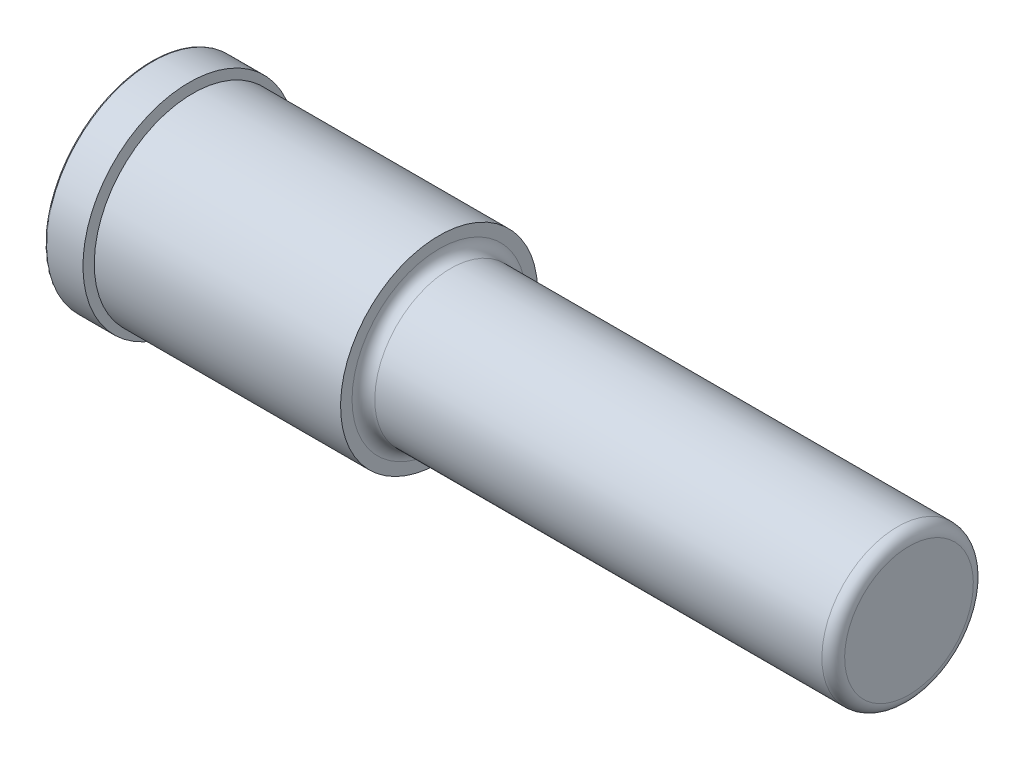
from build123d import *


with BuildPart() as part:
    # Sketch1 → Revolve1 (revolve)
    with BuildSketch(Plane.XY, mode=Mode.PRIVATE) as revolve1_sk:
        with BuildLine():
            Line((0, 0), (0, 21.9075))
            ThreePointArc((0, 21.9075), (0.092993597, 22.132006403), (0.3175, 22.225))
            Line((0.3175, 22.225), (7.9375, 22.225))
            Line((7.9375, 22.225), (7.9375, 19.506184))
            Line((7.9375, 19.506184), (8.73125, 19.506184))
            Line((8.73125, 19.506184), (8.73125, 20.6502))
            Line((8.73125, 20.6502), (60.325, 20.6502))
            Line((60.325, 20.6502), (60.325, 18.24355))
            ThreePointArc((60.325, 18.24355), (61.022451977, 16.559751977), (62.70625, 15.8623))
            Line((62.70625, 15.8623), (156.36875, 15.8623))
            ThreePointArc((156.36875, 15.8623), (158.052548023, 15.164848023), (158.75, 13.48105))
            Line((158.75, 13.48105), (158.75, 0))
            Line((158.75, 0), (0, 0))
        make_face()
    revolve(revolve1_sk.sketch.rotate(Axis((158.75, 0, 0), (-1, 0, 0)), 180), axis=Axis((158.75, 0, 0), (-1, 0, 0)))


solid = part.part
